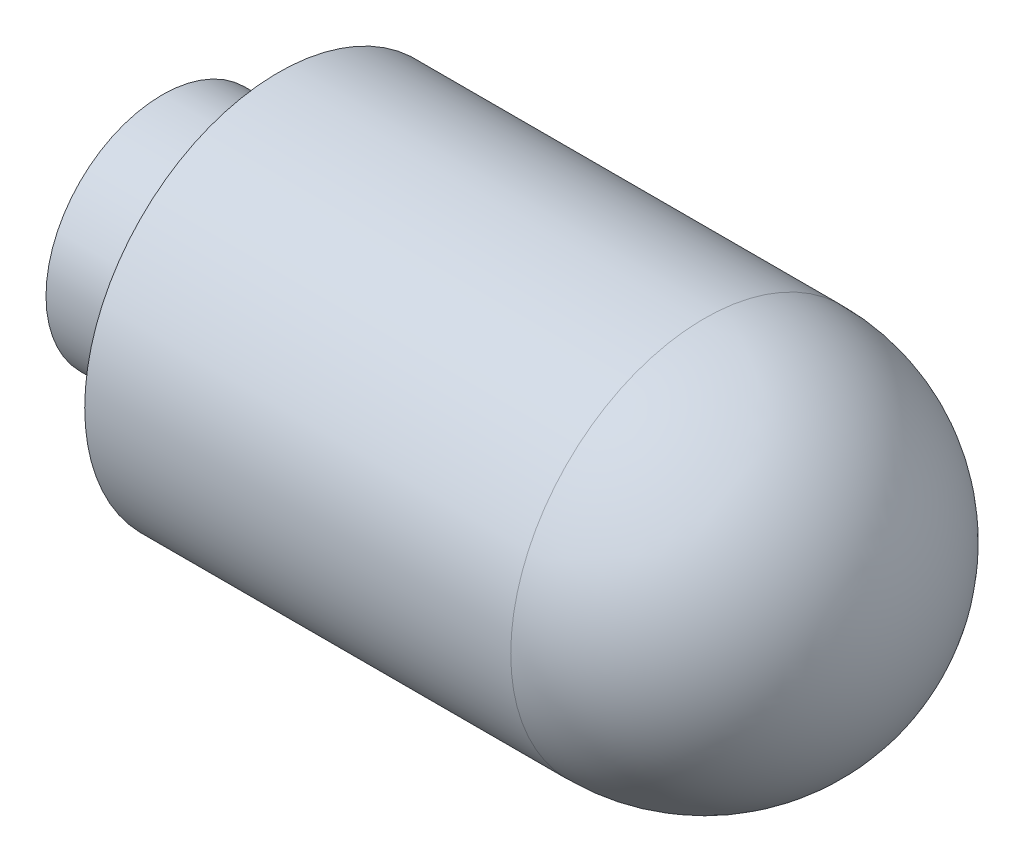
ISO-10303-21;
HEADER;
FILE_DESCRIPTION(('STEP AP214'),'2;1');
FILE_NAME('part.step','',(''),(''),'','','');
FILE_SCHEMA(('AUTOMOTIVE_DESIGN { 1 0 10303 214 1 1 1 1 }'));
ENDSEC;
DATA;
#1=APPLICATION_CONTEXT('core data for automotive mechanical design processes');
#2=APPLICATION_PROTOCOL_DEFINITION('international standard','automotive_design',2000,#1);
#3=PRODUCT_CONTEXT('',#1,'mechanical');
#4=PRODUCT('Part','Part','',(#3));
#5=PRODUCT_RELATED_PRODUCT_CATEGORY('part','',(#4));
#6=PRODUCT_DEFINITION_FORMATION('','',#4);
#7=PRODUCT_DEFINITION_CONTEXT('part definition',#1,'design');
#8=PRODUCT_DEFINITION('design','',#6,#7);
#9=PRODUCT_DEFINITION_SHAPE('','',#8);
#10=(LENGTH_UNIT() NAMED_UNIT(*) SI_UNIT(.MILLI.,.METRE.));
#11=(NAMED_UNIT(*) PLANE_ANGLE_UNIT() SI_UNIT($,.RADIAN.));
#12=(NAMED_UNIT(*) SI_UNIT($,.STERADIAN.) SOLID_ANGLE_UNIT());
#13=UNCERTAINTY_MEASURE_WITH_UNIT(LENGTH_MEASURE(1.E-05),#10,'distance_accuracy_value','');
#14=(GEOMETRIC_REPRESENTATION_CONTEXT(3) GLOBAL_UNCERTAINTY_ASSIGNED_CONTEXT((#13)) GLOBAL_UNIT_ASSIGNED_CONTEXT((#10,
#11,#12)) REPRESENTATION_CONTEXT('',''));
#15=CARTESIAN_POINT('',(0.,0.,0.));
#16=DIRECTION('',(0.,0.,1.));
#17=DIRECTION('',(1.,0.,0.));
#18=AXIS2_PLACEMENT_3D('',#15,#16,#17);
#19=CARTESIAN_POINT('',(0.,0.,0.));
#20=DIRECTION('',(1.,0.,0.));
#21=DIRECTION('',(0.,0.,-1.));
#22=AXIS2_PLACEMENT_3D('',#19,#20,#21);
#23=PLANE('',#22);
#24=CARTESIAN_POINT('',(0.,0.,0.));
#25=DIRECTION('',(-1.,0.,0.));
#26=DIRECTION('',(0.,0.,1.));
#27=AXIS2_PLACEMENT_3D('',#24,#25,#26);
#28=CIRCLE('',#27,1.5);
#29=CARTESIAN_POINT('',(0.,0.,1.5));
#30=VERTEX_POINT('',#29);
#31=EDGE_CURVE('E48',#30,#30,#28,.T.);
#32=ORIENTED_EDGE('',*,*,#31,.T.);
#33=EDGE_LOOP('',(#32));
#34=FACE_BOUND('',#33,.T.);
#35=ADVANCED_FACE('F41',(#34),#23,.F.);
#36=CARTESIAN_POINT('',(-4.21424549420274,0.,0.));
#37=DIRECTION('',(-1.,0.,0.));
#38=DIRECTION('',(0.,0.,1.));
#39=AXIS2_PLACEMENT_3D('',#36,#37,#38);
#40=CYLINDRICAL_SURFACE('',#39,1.5);
#41=ORIENTED_EDGE('',*,*,#31,.F.);
#42=EDGE_LOOP('',(#41));
#43=FACE_BOUND('',#42,.T.);
#44=CARTESIAN_POINT('',(1.5,0.,0.));
#45=DIRECTION('',(-1.,0.,0.));
#46=DIRECTION('',(0.,0.,1.));
#47=AXIS2_PLACEMENT_3D('',#44,#45,#46);
#48=CIRCLE('',#47,1.5);
#49=CARTESIAN_POINT('',(1.5,0.,1.5));
#50=VERTEX_POINT('',#49);
#51=EDGE_CURVE('E52',#50,#50,#48,.T.);
#52=ORIENTED_EDGE('',*,*,#51,.T.);
#53=EDGE_LOOP('',(#52));
#54=FACE_BOUND('',#53,.T.);
#55=ADVANCED_FACE('F72',(#43,#54),#40,.T.);
#56=CARTESIAN_POINT('',(1.5,1.5,0.));
#57=DIRECTION('',(1.,0.,0.));
#58=DIRECTION('',(0.,0.,-1.));
#59=AXIS2_PLACEMENT_3D('',#56,#57,#58);
#60=PLANE('',#59);
#61=ORIENTED_EDGE('',*,*,#51,.F.);
#62=EDGE_LOOP('',(#61));
#63=FACE_BOUND('',#62,.T.);
#64=CARTESIAN_POINT('',(1.5,0.,0.));
#65=DIRECTION('',(-1.,0.,0.));
#66=DIRECTION('',(0.,0.,1.));
#67=AXIS2_PLACEMENT_3D('',#64,#65,#66);
#68=CIRCLE('',#67,2.5);
#69=CARTESIAN_POINT('',(1.5,0.,2.5));
#70=VERTEX_POINT('',#69);
#71=EDGE_CURVE('E56',#70,#70,#68,.T.);
#72=ORIENTED_EDGE('',*,*,#71,.T.);
#73=EDGE_LOOP('',(#72));
#74=FACE_BOUND('',#73,.T.);
#75=ADVANCED_FACE('F62',(#63,#74),#60,.F.);
#76=CARTESIAN_POINT('',(-4.21424549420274,0.,0.));
#77=DIRECTION('',(-1.,0.,0.));
#78=DIRECTION('',(0.,0.,1.));
#79=AXIS2_PLACEMENT_3D('',#76,#77,#78);
#80=CYLINDRICAL_SURFACE('',#79,2.5);
#81=CARTESIAN_POINT('',(7.,0.,0.));
#82=DIRECTION('',(-1.,0.,0.));
#83=DIRECTION('',(0.,0.,1.));
#84=AXIS2_PLACEMENT_3D('',#81,#82,#83);
#85=CIRCLE('',#84,2.5);
#86=CARTESIAN_POINT('',(7.,0.,2.5));
#87=VERTEX_POINT('',#86);
#88=EDGE_CURVE('E10',#87,#87,#85,.T.);
#89=ORIENTED_EDGE('',*,*,#88,.T.);
#90=EDGE_LOOP('',(#89));
#91=FACE_BOUND('',#90,.T.);
#92=ORIENTED_EDGE('',*,*,#71,.F.);
#93=EDGE_LOOP('',(#92));
#94=FACE_BOUND('',#93,.T.);
#95=ADVANCED_FACE('F64',(#91,#94),#80,.T.);
#96=CARTESIAN_POINT('',(7.,0.,0.));
#97=DIRECTION('',(0.,0.,1.));
#98=DIRECTION('',(1.,0.,0.));
#99=AXIS2_PLACEMENT_3D('',#96,#97,#98);
#100=SPHERICAL_SURFACE('',#99,2.5);
#101=CARTESIAN_POINT('',(7.,0.,0.));
#102=DIRECTION('',(-1.,0.,0.));
#103=DIRECTION('',(0.,0.,1.));
#104=AXIS2_PLACEMENT_3D('',#101,#102,#103);
#105=SPHERICAL_SURFACE('',#104,2.5);
#106=ORIENTED_EDGE('',*,*,#88,.F.);
#107=EDGE_LOOP('',(#106));
#108=FACE_BOUND('',#107,.T.);
#109=ADVANCED_FACE('F43',(#108),#105,.T.);
#110=CLOSED_SHELL('',(#35,#55,#75,#95,#109));
#111=MANIFOLD_SOLID_BREP('B2',#110);
#112=ADVANCED_BREP_SHAPE_REPRESENTATION('',(#18,#111),#14);
#113=SHAPE_DEFINITION_REPRESENTATION(#9,#112);
ENDSEC;
END-ISO-10303-21;
